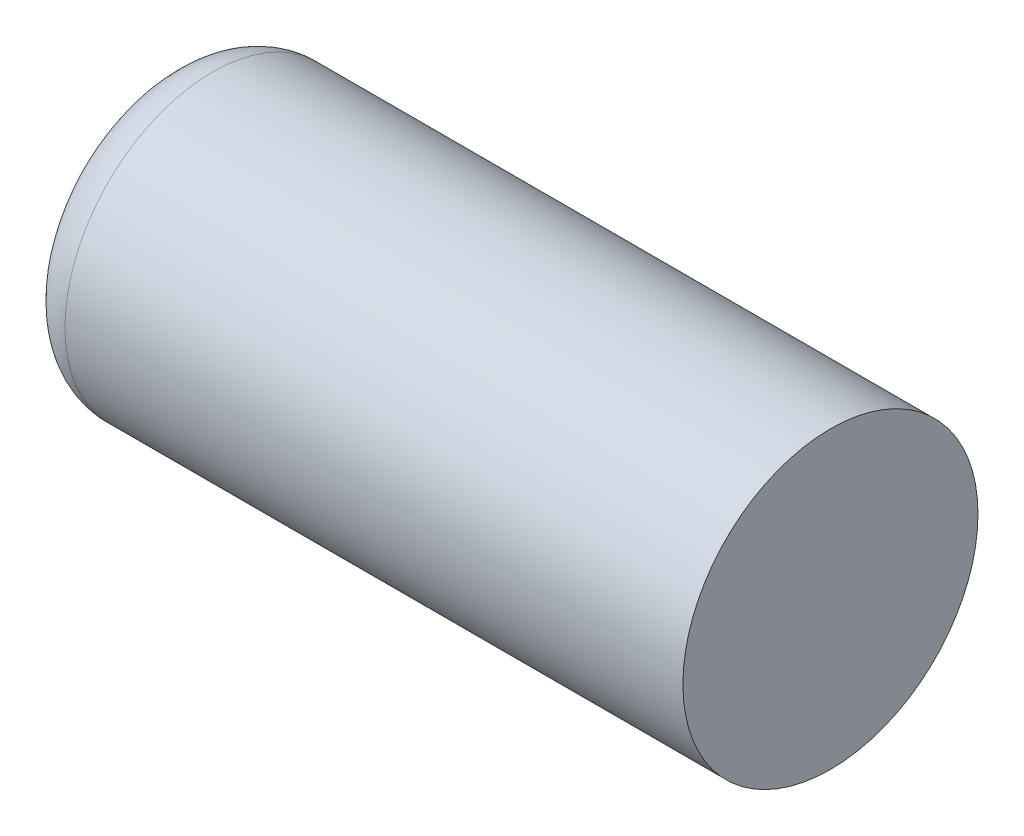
ISO-10303-21;
HEADER;
FILE_DESCRIPTION(('STEP AP214'),'2;1');
FILE_NAME('part.step','',(''),(''),'','','');
FILE_SCHEMA(('AUTOMOTIVE_DESIGN { 1 0 10303 214 1 1 1 1 }'));
ENDSEC;
DATA;
#1=APPLICATION_CONTEXT('core data for automotive mechanical design processes');
#2=APPLICATION_PROTOCOL_DEFINITION('international standard','automotive_design',2000,#1);
#3=PRODUCT_CONTEXT('',#1,'mechanical');
#4=PRODUCT('Part','Part','',(#3));
#5=PRODUCT_RELATED_PRODUCT_CATEGORY('part','',(#4));
#6=PRODUCT_DEFINITION_FORMATION('','',#4);
#7=PRODUCT_DEFINITION_CONTEXT('part definition',#1,'design');
#8=PRODUCT_DEFINITION('design','',#6,#7);
#9=PRODUCT_DEFINITION_SHAPE('','',#8);
#10=(LENGTH_UNIT() NAMED_UNIT(*) SI_UNIT(.MILLI.,.METRE.));
#11=(NAMED_UNIT(*) PLANE_ANGLE_UNIT() SI_UNIT($,.RADIAN.));
#12=(NAMED_UNIT(*) SI_UNIT($,.STERADIAN.) SOLID_ANGLE_UNIT());
#13=UNCERTAINTY_MEASURE_WITH_UNIT(LENGTH_MEASURE(1.E-05),#10,'distance_accuracy_value','');
#14=(GEOMETRIC_REPRESENTATION_CONTEXT(3) GLOBAL_UNCERTAINTY_ASSIGNED_CONTEXT((#13)) GLOBAL_UNIT_ASSIGNED_CONTEXT((#10,
#11,#12)) REPRESENTATION_CONTEXT('',''));
#15=CARTESIAN_POINT('',(0.,0.,0.));
#16=DIRECTION('',(0.,0.,1.));
#17=DIRECTION('',(1.,0.,0.));
#18=AXIS2_PLACEMENT_3D('',#15,#16,#17);
#19=CARTESIAN_POINT('',(1.3,0.,1.5));
#20=DIRECTION('',(1.,0.,0.));
#21=DIRECTION('',(0.,0.,-1.));
#22=AXIS2_PLACEMENT_3D('',#19,#20,#21);
#23=PLANE('',#22);
#24=CARTESIAN_POINT('',(1.3,0.,1.5));
#25=DIRECTION('',(1.,0.,0.));
#26=DIRECTION('',(0.,0.,-1.));
#27=AXIS2_PLACEMENT_3D('',#24,#25,#26);
#28=CIRCLE('',#27,0.659999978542);
#29=CARTESIAN_POINT('',(1.3,0.,0.840000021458));
#30=VERTEX_POINT('',#29);
#31=EDGE_CURVE('E27',#30,#30,#28,.T.);
#32=ORIENTED_EDGE('',*,*,#31,.F.);
#33=EDGE_LOOP('',(#32));
#34=FACE_BOUND('',#33,.T.);
#35=ADVANCED_FACE('F15',(#34),#23,.F.);
#36=CARTESIAN_POINT('',(5.620000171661,0.,1.5));
#37=DIRECTION('',(1.,0.,0.));
#38=DIRECTION('',(0.,0.,-1.));
#39=AXIS2_PLACEMENT_3D('',#36,#37,#38);
#40=PLANE('',#39);
#41=CARTESIAN_POINT('',(5.620000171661,0.,1.5));
#42=DIRECTION('',(1.,0.,0.));
#43=DIRECTION('',(0.,0.,-1.));
#44=AXIS2_PLACEMENT_3D('',#41,#42,#43);
#45=CIRCLE('',#44,0.959999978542);
#46=CARTESIAN_POINT('',(5.620000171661,0.,0.540000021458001));
#47=VERTEX_POINT('',#46);
#48=EDGE_CURVE('E19',#47,#47,#45,.F.);
#49=ORIENTED_EDGE('',*,*,#48,.F.);
#50=EDGE_LOOP('',(#49));
#51=FACE_BOUND('',#50,.T.);
#52=ADVANCED_FACE('F39',(#51),#40,.T.);
#53=CARTESIAN_POINT('',(1.6,0.,1.5));
#54=DIRECTION('',(-1.,0.,0.));
#55=DIRECTION('',(0.,0.,-1.));
#56=AXIS2_PLACEMENT_3D('',#53,#54,#55);
#57=TOROIDAL_SURFACE('',#56,0.659999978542,0.3);
#58=CARTESIAN_POINT('',(1.6,0.,1.5));
#59=DIRECTION('',(1.,0.,0.));
#60=DIRECTION('',(0.,0.,-1.));
#61=AXIS2_PLACEMENT_3D('',#58,#59,#60);
#62=CIRCLE('',#61,0.959999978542);
#63=CARTESIAN_POINT('',(1.6,0.,0.540000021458));
#64=VERTEX_POINT('',#63);
#65=EDGE_CURVE('E10',#64,#64,#62,.T.);
#66=ORIENTED_EDGE('',*,*,#65,.F.);
#67=EDGE_LOOP('',(#66));
#68=FACE_BOUND('',#67,.T.);
#69=ORIENTED_EDGE('',*,*,#31,.T.);
#70=EDGE_LOOP('',(#69));
#71=FACE_BOUND('',#70,.T.);
#72=ADVANCED_FACE('F34',(#68,#71),#57,.T.);
#73=CARTESIAN_POINT('',(1.3,0.,1.5));
#74=DIRECTION('',(1.,0.,0.));
#75=DIRECTION('',(0.,0.,-1.));
#76=AXIS2_PLACEMENT_3D('',#73,#74,#75);
#77=CYLINDRICAL_SURFACE('',#76,0.959999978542);
#78=ORIENTED_EDGE('',*,*,#48,.T.);
#79=EDGE_LOOP('',(#78));
#80=FACE_BOUND('',#79,.T.);
#81=ORIENTED_EDGE('',*,*,#65,.T.);
#82=EDGE_LOOP('',(#81));
#83=FACE_BOUND('',#82,.T.);
#84=ADVANCED_FACE('F38',(#80,#83),#77,.T.);
#85=CLOSED_SHELL('',(#35,#52,#72,#84));
#86=MANIFOLD_SOLID_BREP('B1',#85);
#87=ADVANCED_BREP_SHAPE_REPRESENTATION('',(#18,#86),#14);
#88=SHAPE_DEFINITION_REPRESENTATION(#9,#87);
ENDSEC;
END-ISO-10303-21;
